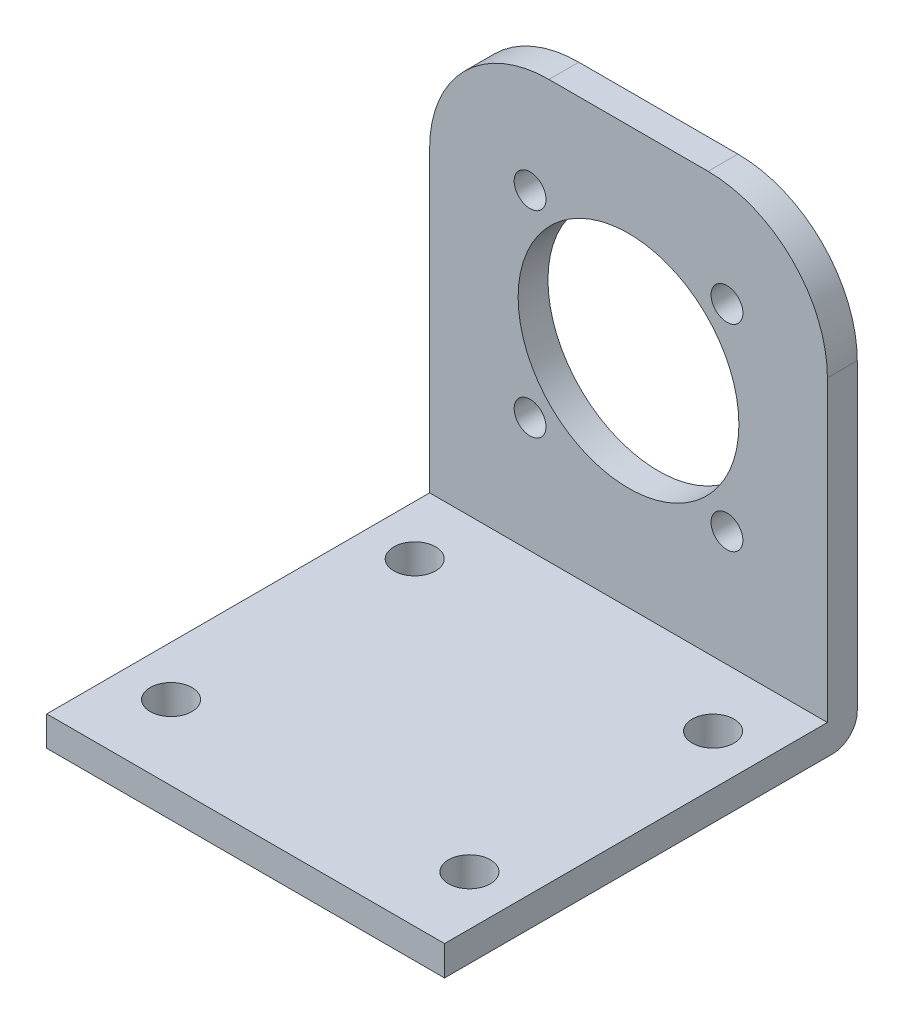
from build123d import *

# Parameters (mm, degrees)
BOSS_EXTRUDE1_DEPTH = 40
SKETCH2_R           = 11.1
SKETCH2_R_2         = 1.6
CUT_EXTRUDE1_DEPTH  = 40
CUT_EXTRUDE2_DEPTH  = 40
SKETCH4_R           = 2.1
CUT_EXTRUDE3_DEPTH  = 40


with BuildPart() as part:
    # Sketch1 → Boss-Extrude1 (new body)
    with BuildSketch(Plane(origin=(0, 0, 0), x_dir=(0, 0, -1), z_dir=(1, 0, 0))):
        with BuildLine():
            Line((23.14644626, 33.419460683), (23.14644626, -8.580539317))
            Line((23.14644626, -8.580539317), (-15.35355374, -8.580539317))
            Line((-15.35355374, -8.580539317), (-15.35355374, -11.580539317))
            Line((-15.35355374, -11.580539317), (23.64644626, -11.580539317))
            ThreePointArc((23.64644626, -11.580539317), (25.414213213, -10.84830627), (26.14644626, -9.080539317))
            Line((26.14644626, -9.080539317), (26.14644626, 33.419460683))
            Line((26.14644626, 33.419460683), (23.14644626, 33.419460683))
        make_face()
    extrude(amount=-BOSS_EXTRUDE1_DEPTH)

    # Sketch2 → Cut-Extrude1 (cut)
    with BuildSketch(Plane.XY.offset(-23.14644626)):
        with Locations((-20, 12.919460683)):
            Circle(SKETCH2_R)
        with Locations((-10.100505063, 22.818955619)):
            Circle(SKETCH2_R_2)
        with Locations((-29.899494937, 3.019965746)):
            Circle(SKETCH2_R_2)
        with Locations((-29.899494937, 22.818955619)):
            Circle(SKETCH2_R_2)
        with Locations((-10.100505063, 3.019965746)):
            Circle(SKETCH2_R_2)
    extrude(amount=-CUT_EXTRUDE1_DEPTH, mode=Mode.SUBTRACT)

    # Sketch3 → Cut-Extrude2 (cut)
    with BuildSketch(Plane.XY.offset(-23.14644626)):
        with BuildLine():
            Line((0, 21.419460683), (0, 33.419460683))
            Line((0, 33.419460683), (-12, 33.419460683))
            ThreePointArc((-12, 33.419460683), (-3.514718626, 29.904742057), (0, 21.419460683))
        make_face()
        with BuildLine():
            Line((-28, 33.419460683), (-40, 33.419460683))
            Line((-40, 33.419460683), (-40, 21.419460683))
            ThreePointArc((-40, 21.419460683), (-36.485281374, 29.904742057), (-28, 33.419460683))
        make_face()
    extrude(amount=-CUT_EXTRUDE2_DEPTH, mode=Mode.SUBTRACT)

    # Sketch4 → Cut-Extrude3 (cut)
    with BuildSketch(Plane(origin=(0, -8.580539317, 0), x_dir=(1, 0, 0), z_dir=(0, 1, 0))):
        with Locations(Location((-5, -7.85355374, 0), (0, 0, 270))):
            Circle(SKETCH4_R)
        with Locations(Location((-35, -7.85355374, 0), (0, 0, 270))):
            Circle(SKETCH4_R)
        with Locations(Location((-35, 16.64644626, 0), (0, 0, 270))):
            Circle(SKETCH4_R)
        with Locations(Location((-5, 16.64644626, 0), (0, 0, 270))):
            Circle(SKETCH4_R)
    extrude(amount=-CUT_EXTRUDE3_DEPTH, mode=Mode.SUBTRACT)


solid = part.part
